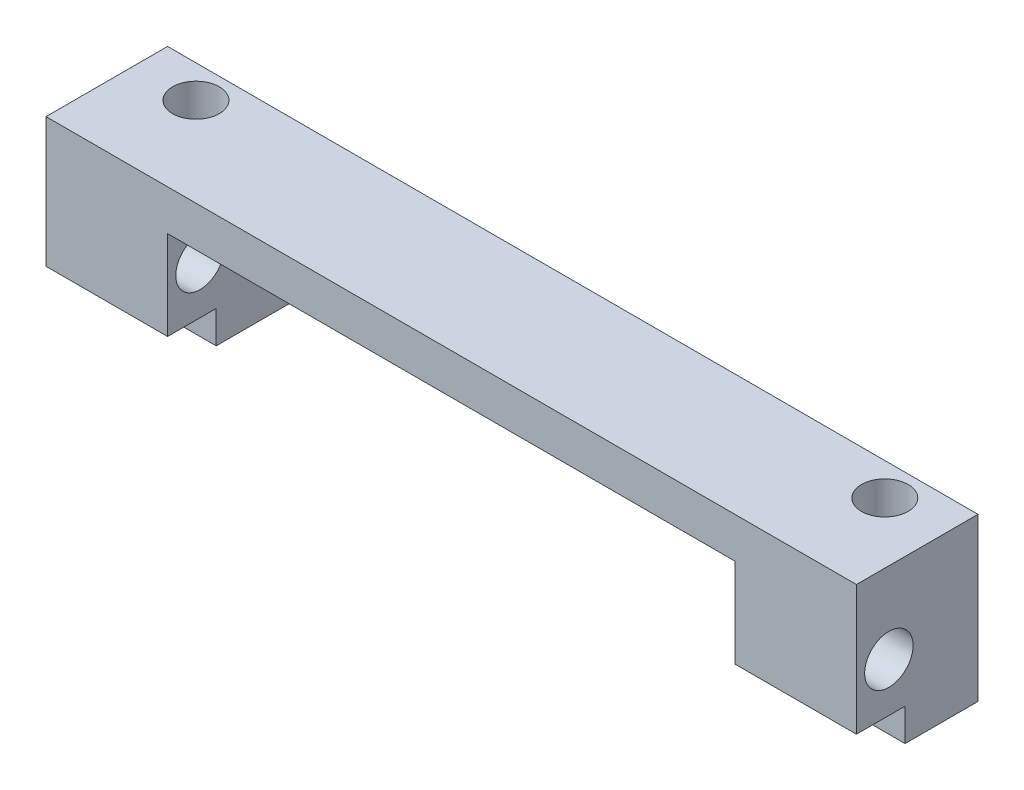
from build123d import *

# Parameters (mm, degrees)
SKETCH1_W                 = 63.5
SKETCH1_H                 = 9.525
SKETCH1_R                 = 1.8288
EXTRUDE1_DEPTH            = 12.7
SKETCH2_W                 = 44.45
SKETCH2_H                 = 9.525
CUT_EXTRUDE1_DEPTH        = 9.525
F_6_CLEARANCE_HOLE1_D     = 3.7973
F_6_CLEARANCE_HOLE1_DEPTH = 78.74
F_6_CLEARANCE_HOLE1_TIP   = 1.140824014
SKETCH5_W                 = 3.81
SKETCH5_H                 = 2.54
CUT_EXTRUDE2_DEPTH        = 66.454301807


with BuildPart() as part:
    # Sketch1 → Extrude1 (new body)
    with BuildSketch(Plane(origin=(0, 0, 0), x_dir=(1, 0, 0), z_dir=(0, 1, 0))):
        with Locations((0, 4.7625)):
            Rectangle(SKETCH1_W, SKETCH1_H)
        with Locations(Location((-26.9875, 6.985, 0), (0, 0, 270))):
            Circle(SKETCH1_R, mode=Mode.SUBTRACT)
        with Locations(Location((26.9875, 6.985, 0), (0, 0, 270))):
            Circle(SKETCH1_R, mode=Mode.SUBTRACT)
    extrude(amount=EXTRUDE1_DEPTH)

    # Sketch2 → Cut-Extrude1 (cut)
    with BuildSketch(Plane.XY):
        with Locations((0, 4.7625)):
            Rectangle(SKETCH2_W, SKETCH2_H)
    extrude(amount=-CUT_EXTRUDE1_DEPTH, mode=Mode.SUBTRACT)

    # 6 Clearance Hole1
    with Locations(Plane.ZY.offset(31.75)):
        with Locations((-2.54, 6.35)):
            Hole(F_6_CLEARANCE_HOLE1_D / 2, depth=F_6_CLEARANCE_HOLE1_DEPTH)
            with Locations((0, 0, -(F_6_CLEARANCE_HOLE1_DEPTH + F_6_CLEARANCE_HOLE1_TIP / 2))):  # 118° drill point
                Cone(0, F_6_CLEARANCE_HOLE1_D / 2, F_6_CLEARANCE_HOLE1_TIP, mode=Mode.SUBTRACT)

    # Sketch5 → Cut-Extrude2 (cut, through all)
    with BuildSketch(Plane.ZY.offset(31.75)):
        with Locations((-1.905, 1.27)):
            Rectangle(SKETCH5_W, SKETCH5_H)
    extrude(amount=-CUT_EXTRUDE2_DEPTH, mode=Mode.SUBTRACT)


solid = part.part
